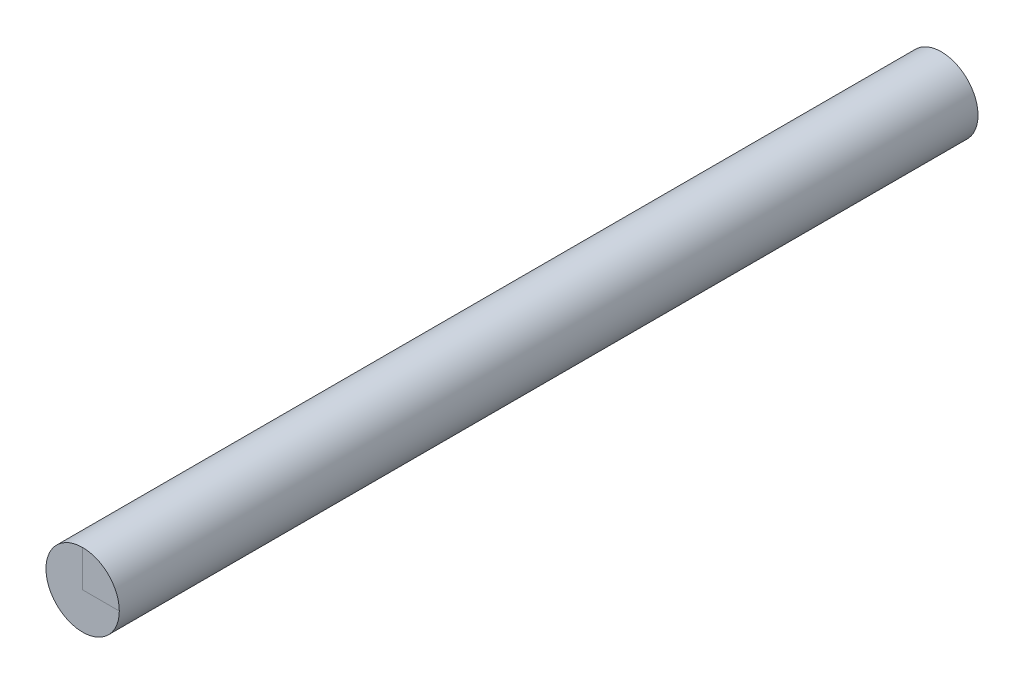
ISO-10303-21;
HEADER;
FILE_DESCRIPTION(('STEP AP214'),'2;1');
FILE_NAME('part.step','',(''),(''),'','','');
FILE_SCHEMA(('AUTOMOTIVE_DESIGN { 1 0 10303 214 1 1 1 1 }'));
ENDSEC;
DATA;
#1=APPLICATION_CONTEXT('core data for automotive mechanical design processes');
#2=APPLICATION_PROTOCOL_DEFINITION('international standard','automotive_design',2000,#1);
#3=PRODUCT_CONTEXT('',#1,'mechanical');
#4=PRODUCT('Part','Part','',(#3));
#5=PRODUCT_RELATED_PRODUCT_CATEGORY('part','',(#4));
#6=PRODUCT_DEFINITION_FORMATION('','',#4);
#7=PRODUCT_DEFINITION_CONTEXT('part definition',#1,'design');
#8=PRODUCT_DEFINITION('design','',#6,#7);
#9=PRODUCT_DEFINITION_SHAPE('','',#8);
#10=(LENGTH_UNIT() NAMED_UNIT(*) SI_UNIT(.MILLI.,.METRE.));
#11=(NAMED_UNIT(*) PLANE_ANGLE_UNIT() SI_UNIT($,.RADIAN.));
#12=(NAMED_UNIT(*) SI_UNIT($,.STERADIAN.) SOLID_ANGLE_UNIT());
#13=UNCERTAINTY_MEASURE_WITH_UNIT(LENGTH_MEASURE(1.E-05),#10,'distance_accuracy_value','');
#14=(GEOMETRIC_REPRESENTATION_CONTEXT(3) GLOBAL_UNCERTAINTY_ASSIGNED_CONTEXT((#13)) GLOBAL_UNIT_ASSIGNED_CONTEXT((#10,
#11,#12)) REPRESENTATION_CONTEXT('',''));
#15=CARTESIAN_POINT('',(0.,0.,0.));
#16=DIRECTION('',(0.,0.,1.));
#17=DIRECTION('',(1.,0.,0.));
#18=AXIS2_PLACEMENT_3D('',#15,#16,#17);
#19=CARTESIAN_POINT('',(15.0445459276,0.,-352.2782990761));
#20=DIRECTION('',(0.,0.,-1.));
#21=DIRECTION('',(-1.,0.,0.));
#22=AXIS2_PLACEMENT_3D('',#19,#20,#21);
#23=PLANE('',#22);
#24=CARTESIAN_POINT('',(0.,0.,-352.2782990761));
#25=DIRECTION('',(0.,0.,1.));
#26=DIRECTION('',(1.,0.,0.));
#27=AXIS2_PLACEMENT_3D('',#24,#25,#26);
#28=CIRCLE('',#27,15.0445459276);
#29=CARTESIAN_POINT('',(0.,15.0445459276,-352.2782990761));
#30=VERTEX_POINT('',#29);
#31=CARTESIAN_POINT('',(15.0445459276,0.,-352.2782990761));
#32=VERTEX_POINT('',#31);
#33=EDGE_CURVE('E90',#30,#32,#28,.T.);
#34=ORIENTED_EDGE('',*,*,#33,.F.);
#35=DIRECTION('',(0.,-1.,0.));
#36=VECTOR('',#35,1.);
#37=CARTESIAN_POINT('',(0.,0.,-352.2782990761));
#38=LINE('',#37,#36);
#39=CARTESIAN_POINT('',(0.,0.,-352.2782990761));
#40=VERTEX_POINT('',#39);
#41=EDGE_CURVE('E11',#30,#40,#38,.T.);
#42=ORIENTED_EDGE('',*,*,#41,.T.);
#43=DIRECTION('',(1.,0.,0.));
#44=VECTOR('',#43,1.);
#45=CARTESIAN_POINT('',(15.0445459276,0.,-352.2782990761));
#46=LINE('',#45,#44);
#47=EDGE_CURVE('E46',#40,#32,#46,.T.);
#48=ORIENTED_EDGE('',*,*,#47,.T.);
#49=EDGE_LOOP('',(#34,#42,#48));
#50=FACE_BOUND('',#49,.T.);
#51=ADVANCED_FACE('F36',(#50),#23,.T.);
#52=CARTESIAN_POINT('',(0.,0.,0.));
#53=DIRECTION('',(0.,0.,1.));
#54=DIRECTION('',(1.,0.,0.));
#55=AXIS2_PLACEMENT_3D('',#52,#53,#54);
#56=PLANE('',#55);
#57=DIRECTION('',(-1.,0.,0.));
#58=VECTOR('',#57,1.);
#59=CARTESIAN_POINT('',(0.,0.,0.));
#60=LINE('',#59,#58);
#61=CARTESIAN_POINT('',(15.0445459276,0.,0.));
#62=VERTEX_POINT('',#61);
#63=CARTESIAN_POINT('',(0.,0.,0.));
#64=VERTEX_POINT('',#63);
#65=EDGE_CURVE('E40',#62,#64,#60,.T.);
#66=ORIENTED_EDGE('',*,*,#65,.T.);
#67=DIRECTION('',(0.,1.,0.));
#68=VECTOR('',#67,1.);
#69=CARTESIAN_POINT('',(0.,0.,0.));
#70=LINE('',#69,#68);
#71=CARTESIAN_POINT('',(0.,15.0445459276,0.));
#72=VERTEX_POINT('',#71);
#73=EDGE_CURVE('E74',#64,#72,#70,.T.);
#74=ORIENTED_EDGE('',*,*,#73,.T.);
#75=CARTESIAN_POINT('',(0.,0.,0.));
#76=DIRECTION('',(0.,0.,1.));
#77=DIRECTION('',(1.,0.,0.));
#78=AXIS2_PLACEMENT_3D('',#75,#76,#77);
#79=CIRCLE('',#78,15.0445459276);
#80=EDGE_CURVE('E78',#72,#62,#79,.T.);
#81=ORIENTED_EDGE('',*,*,#80,.T.);
#82=EDGE_LOOP('',(#66,#74,#81));
#83=FACE_BOUND('',#82,.T.);
#84=ADVANCED_FACE('F79',(#83),#56,.T.);
#85=CARTESIAN_POINT('',(0.,0.,-238.731707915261));
#86=DIRECTION('',(0.,0.,1.));
#87=DIRECTION('',(1.,0.,0.));
#88=AXIS2_PLACEMENT_3D('',#85,#86,#87);
#89=CYLINDRICAL_SURFACE('',#88,15.0445459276);
#90=EDGE_CURVE('E81',#32,#30,#28,.T.);
#91=ORIENTED_EDGE('',*,*,#90,.T.);
#92=ORIENTED_EDGE('',*,*,#33,.T.);
#93=EDGE_LOOP('',(#91,#92));
#94=FACE_BOUND('',#93,.T.);
#95=EDGE_CURVE('E73',#62,#72,#79,.T.);
#96=ORIENTED_EDGE('',*,*,#95,.F.);
#97=ORIENTED_EDGE('',*,*,#80,.F.);
#98=EDGE_LOOP('',(#96,#97));
#99=FACE_BOUND('',#98,.T.);
#100=ADVANCED_FACE('F38',(#94,#99),#89,.T.);
#101=ORIENTED_EDGE('',*,*,#73,.F.);
#102=ORIENTED_EDGE('',*,*,#65,.F.);
#103=ORIENTED_EDGE('',*,*,#95,.T.);
#104=EDGE_LOOP('',(#101,#102,#103));
#105=FACE_BOUND('',#104,.T.);
#106=ADVANCED_FACE('F71',(#105),#56,.T.);
#107=ORIENTED_EDGE('',*,*,#41,.F.);
#108=ORIENTED_EDGE('',*,*,#90,.F.);
#109=ORIENTED_EDGE('',*,*,#47,.F.);
#110=EDGE_LOOP('',(#107,#108,#109));
#111=FACE_BOUND('',#110,.T.);
#112=ADVANCED_FACE('F93',(#111),#23,.T.);
#113=CLOSED_SHELL('',(#51,#84,#100,#106,#112));
#114=MANIFOLD_SOLID_BREP('B2',#113);
#115=ADVANCED_BREP_SHAPE_REPRESENTATION('',(#18,#114),#14);
#116=SHAPE_DEFINITION_REPRESENTATION(#9,#115);
ENDSEC;
END-ISO-10303-21;
